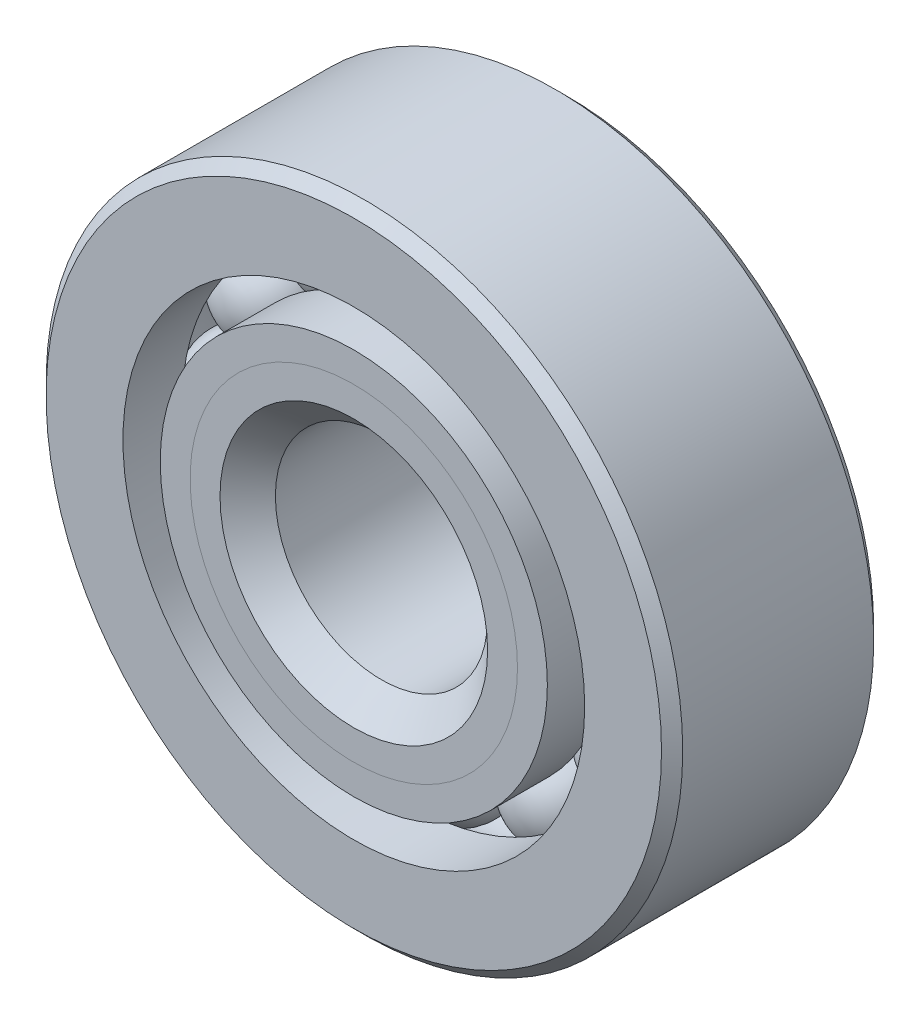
from build123d import *

# Parameters (mm, degrees)
CIRPATTERN1_COUNT = 12


with BuildPart() as part:
    # Sketch1 → Revolve1 (revolve)
    with BuildSketch(Plane(origin=(0, 0, 0), x_dir=(0, 0, -1), z_dir=(1, 0, 0)), mode=Mode.PRIVATE) as revolve1_sk:
        with BuildLine():
            Line((4.28625, 14.2875), (-4.28625, 14.2875))
            Line((-4.28625, 14.2875), (-4.7625, 13.81125))
            Line((-4.7625, 13.81125), (-4.7625, 10.362362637))
            Line((-4.7625, 10.362362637), (-2.116666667, 10.362362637))
            ThreePointArc((-2.116666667, 10.362362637), (0, 11.801280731), (2.116666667, 10.362362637))
            Line((2.116666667, 10.362362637), (4.7625, 10.362362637))
            Line((4.7625, 10.362362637), (4.7625, 13.81125))
            Line((4.7625, 13.81125), (4.28625, 14.2875))
        make_face()
    revolve(revolve1_sk.sketch.rotate(Axis((0, 0, 4.7625), (0, 0, -1)), 90), axis=Axis((0, 0, 4.7625), (0, 0, -1)))


with BuildPart() as body_2:
    # Sketch2 → Revolve2 (revolve)
    with BuildSketch(Plane(origin=(0, 0, 0), x_dir=(0, 0, -1), z_dir=(1, 0, 0)), mode=Mode.PRIVATE) as revolve2_sk:
        with BuildLine():
            Line((-4.7625, 8.687637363), (-2.116666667, 8.687637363))
            ThreePointArc((-2.116666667, 8.687637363), (-1.279722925, 7.642511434), (0, 7.248719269))
            Line((0, 7.248719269), (0, 6.005609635))
            Line((0, 6.005609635), (-3.421486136, 6.005609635))
            Line((-3.421486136, 6.005609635), (-4.7625, 7.346623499))
            Line((-4.7625, 7.346623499), (-4.7625, 8.687637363))
        make_face()
    revolve(revolve2_sk.sketch.rotate(Axis((0, 0, 4.7625), (0, 0, -1)), 90), axis=Axis((0, 0, 4.7625), (0, 0, -1)))


with BuildPart() as body_3:
    # Sketch3 → Revolve3 (revolve)
    with BuildSketch(Plane(origin=(0, 0, 0), x_dir=(0, 0, -1), z_dir=(1, 0, 0)), mode=Mode.PRIVATE) as revolve3_sk:
        with BuildLine():
            Line((-4.7625, 7.346623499), (-3.421486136, 6.005609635))
            Line((-3.421486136, 6.005609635), (0, 6.005609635))
            Line((0, 6.005609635), (0, 7.248719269))
            ThreePointArc((0, 7.248719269), (1.279722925, 7.642511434), (2.116666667, 8.687637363))
            Line((2.116666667, 8.687637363), (4.7625, 8.687637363))
            Line((4.7625, 8.687637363), (4.7625, 5.23875))
            Line((4.7625, 5.23875), (4.28625, 4.7625))
            Line((4.28625, 4.7625), (-3.519390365, 4.7625))
            Line((-3.519390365, 4.7625), (-4.7625, 6.005609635))
            Line((-4.7625, 6.005609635), (-4.7625, 7.346623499))
        make_face()
    revolve(revolve3_sk.sketch.rotate(Axis((0, 0, 4.7625), (0, 0, -1)), 90), axis=Axis((0, 0, 4.7625), (0, 0, -1)))


with BuildPart() as body_4:
    # Sketch4 → Revolve4 (revolve)
    with BuildSketch(Plane(origin=(0, 0, 0), x_dir=(0, 0, -1), z_dir=(1, 0, 0))):
        with BuildLine():
            Line((-2.276280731, 9.525), (2.276280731, 9.525))
            ThreePointArc((2.276280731, 9.525), (0, 11.801280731), (-2.276280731, 9.525))
        make_face()
    revolve(axis=Axis((0, 9.525, 2.276280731), (0, 0, -1)))


with BuildPart() as cirpattern1_1:
    # CirPattern1: pattern copy
    add(body_4.part.rotate(Axis((0, 0, 0), (0, 0, 1)), 1 * 360 / CIRPATTERN1_COUNT))


with BuildPart() as cirpattern1_2:
    # CirPattern1: pattern copy
    add(body_4.part.rotate(Axis((0, 0, 0), (0, 0, 1)), 2 * 360 / CIRPATTERN1_COUNT))


with BuildPart() as cirpattern1_3:
    # CirPattern1: pattern copy
    add(body_4.part.rotate(Axis((0, 0, 0), (0, 0, 1)), 3 * 360 / CIRPATTERN1_COUNT))


with BuildPart() as cirpattern1_4:
    # CirPattern1: pattern copy
    add(body_4.part.rotate(Axis((0, 0, 0), (0, 0, 1)), 4 * 360 / CIRPATTERN1_COUNT))


with BuildPart() as cirpattern1_5:
    # CirPattern1: pattern copy
    add(body_4.part.rotate(Axis((0, 0, 0), (0, 0, 1)), 5 * 360 / CIRPATTERN1_COUNT))


with BuildPart() as cirpattern1_6:
    # CirPattern1: pattern copy
    add(body_4.part.rotate(Axis((0, 0, 0), (0, 0, 1)), 6 * 360 / CIRPATTERN1_COUNT))


with BuildPart() as cirpattern1_7:
    # CirPattern1: pattern copy
    add(body_4.part.rotate(Axis((0, 0, 0), (0, 0, 1)), 7 * 360 / CIRPATTERN1_COUNT))


with BuildPart() as cirpattern1_8:
    # CirPattern1: pattern copy
    add(body_4.part.rotate(Axis((0, 0, 0), (0, 0, 1)), 8 * 360 / CIRPATTERN1_COUNT))


with BuildPart() as cirpattern1_9:
    # CirPattern1: pattern copy
    add(body_4.part.rotate(Axis((0, 0, 0), (0, 0, 1)), 9 * 360 / CIRPATTERN1_COUNT))


with BuildPart() as cirpattern1_10:
    # CirPattern1: pattern copy
    add(body_4.part.rotate(Axis((0, 0, 0), (0, 0, 1)), 10 * 360 / CIRPATTERN1_COUNT))


with BuildPart() as cirpattern1_11:
    # CirPattern1: pattern copy
    add(body_4.part.rotate(Axis((0, 0, 0), (0, 0, 1)), 11 * 360 / CIRPATTERN1_COUNT))


solid = Compound([part.part, body_2.part, body_3.part, body_4.part, cirpattern1_1.part, cirpattern1_2.part, cirpattern1_3.part, cirpattern1_4.part, cirpattern1_5.part, cirpattern1_6.part, cirpattern1_7.part, cirpattern1_8.part, cirpattern1_9.part, cirpattern1_10.part, cirpattern1_11.part])
